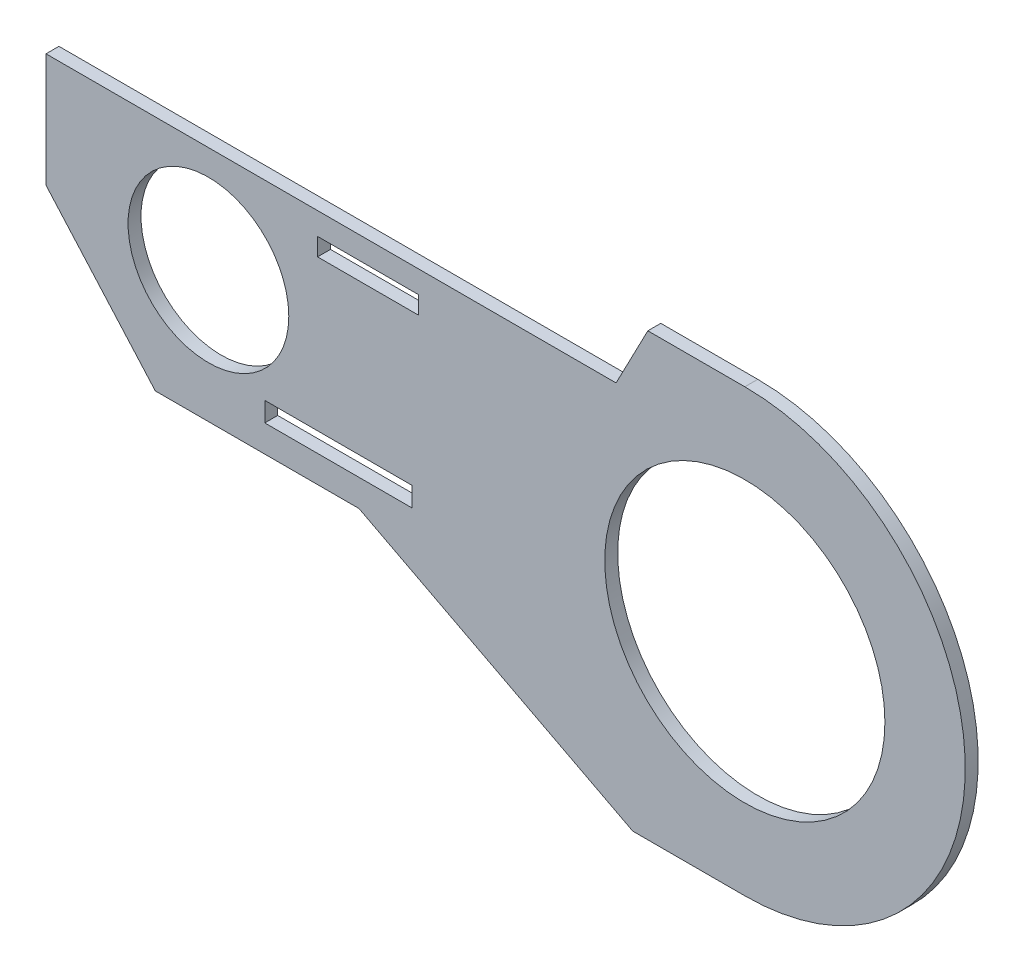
from build123d import *

# Parameters (mm, degrees)
SKETCH1_R           = 75.166609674
SKETCH1_R_2         = 131.026924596
SKETCH1_W           = 94.417787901
SKETCH1_H           = 16.586908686
SKETCH1_W_2         = 137.518986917
SKETCH1_H_2         = 18.284458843
BOSS_EXTRUDE1_DEPTH = 12.1


with BuildPart() as part:
    # Sketch1 → Boss-Extrude1 (new body)
    with BuildSketch(Plane.XY):
        with BuildLine():
            Line((0, 0), (256.094013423, -133.290163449))
            Line((256.094013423, -133.290163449), (360.895292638, -133.290163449))
            ThreePointArc((360.895292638, -133.290163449), (567.068379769, 72.882923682), (360.895292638, 279.056010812))
            Line((360.895292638, 279.056010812), (270.184556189, 279.056010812))
            Line((270.184556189, 279.056010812), (240.473508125, 221.971366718))
            Line((240.473508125, 221.971366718), (-292.728145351, 221.971366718))
            Line((-292.728145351, 221.971366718), (-292.728145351, 115.500270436))
            Line((-292.728145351, 115.500270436), (-190.489812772, 0))
            Line((-190.489812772, 0), (0, 0))
        make_face()
        with Locations((-140.807894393, 122.843530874)):
            Circle(SKETCH1_R, mode=Mode.SUBTRACT)
        with Locations((360.895292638, 72.882923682)):
            Circle(SKETCH1_R_2, mode=Mode.SUBTRACT)
        with Locations((8.472744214, 192.764526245)):
            Rectangle(SKETCH1_W, SKETCH1_H, mode=Mode.SUBTRACT)
        with Locations((-19.343794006, 34.424231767)):
            Rectangle(SKETCH1_W_2, SKETCH1_H_2, mode=Mode.SUBTRACT)
    extrude(amount=BOSS_EXTRUDE1_DEPTH)


solid = part.part
